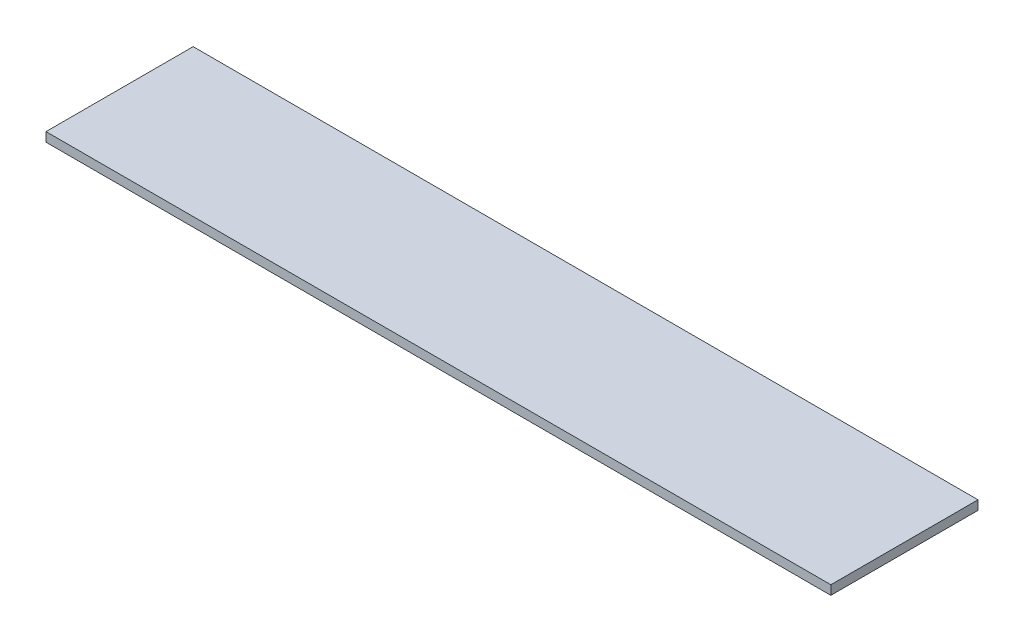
ISO-10303-21;
HEADER;
FILE_DESCRIPTION(('STEP AP214'),'2;1');
FILE_NAME('part.step','',(''),(''),'','','');
FILE_SCHEMA(('AUTOMOTIVE_DESIGN { 1 0 10303 214 1 1 1 1 }'));
ENDSEC;
DATA;
#1=APPLICATION_CONTEXT('core data for automotive mechanical design processes');
#2=APPLICATION_PROTOCOL_DEFINITION('international standard','automotive_design',2000,#1);
#3=PRODUCT_CONTEXT('',#1,'mechanical');
#4=PRODUCT('Part','Part','',(#3));
#5=PRODUCT_RELATED_PRODUCT_CATEGORY('part','',(#4));
#6=PRODUCT_DEFINITION_FORMATION('','',#4);
#7=PRODUCT_DEFINITION_CONTEXT('part definition',#1,'design');
#8=PRODUCT_DEFINITION('design','',#6,#7);
#9=PRODUCT_DEFINITION_SHAPE('','',#8);
#10=(LENGTH_UNIT() NAMED_UNIT(*) SI_UNIT(.MILLI.,.METRE.));
#11=(NAMED_UNIT(*) PLANE_ANGLE_UNIT() SI_UNIT($,.RADIAN.));
#12=(NAMED_UNIT(*) SI_UNIT($,.STERADIAN.) SOLID_ANGLE_UNIT());
#13=UNCERTAINTY_MEASURE_WITH_UNIT(LENGTH_MEASURE(1.E-05),#10,'distance_accuracy_value','');
#14=(GEOMETRIC_REPRESENTATION_CONTEXT(3) GLOBAL_UNCERTAINTY_ASSIGNED_CONTEXT((#13)) GLOBAL_UNIT_ASSIGNED_CONTEXT((#10,
#11,#12)) REPRESENTATION_CONTEXT('',''));
#15=CARTESIAN_POINT('',(0.,0.,0.));
#16=DIRECTION('',(0.,0.,1.));
#17=DIRECTION('',(1.,0.,0.));
#18=AXIS2_PLACEMENT_3D('',#15,#16,#17);
#19=CARTESIAN_POINT('',(812.8,19.05,-152.4));
#20=DIRECTION('',(-1.,0.,0.));
#21=DIRECTION('',(0.,0.,1.));
#22=AXIS2_PLACEMENT_3D('',#19,#20,#21);
#23=PLANE('',#22);
#24=DIRECTION('',(0.,0.,-1.));
#25=VECTOR('',#24,1.);
#26=CARTESIAN_POINT('',(812.8,0.,-152.4));
#27=LINE('',#26,#25);
#28=CARTESIAN_POINT('',(812.8,0.,152.4));
#29=VERTEX_POINT('',#28);
#30=CARTESIAN_POINT('',(812.8,0.,-152.4));
#31=VERTEX_POINT('',#30);
#32=EDGE_CURVE('E101',#29,#31,#27,.T.);
#33=ORIENTED_EDGE('',*,*,#32,.T.);
#34=DIRECTION('',(0.,-1.,0.));
#35=VECTOR('',#34,1.);
#36=CARTESIAN_POINT('',(812.8,19.05,-152.4));
#37=LINE('',#36,#35);
#38=CARTESIAN_POINT('',(812.8,19.05,-152.4));
#39=VERTEX_POINT('',#38);
#40=EDGE_CURVE('E11',#39,#31,#37,.T.);
#41=ORIENTED_EDGE('',*,*,#40,.F.);
#42=DIRECTION('',(0.,0.,-1.));
#43=VECTOR('',#42,1.);
#44=CARTESIAN_POINT('',(812.8,19.05,-152.4));
#45=LINE('',#44,#43);
#46=CARTESIAN_POINT('',(812.8,19.05,152.4));
#47=VERTEX_POINT('',#46);
#48=EDGE_CURVE('E87',#47,#39,#45,.T.);
#49=ORIENTED_EDGE('',*,*,#48,.F.);
#50=DIRECTION('',(0.,-1.,0.));
#51=VECTOR('',#50,1.);
#52=CARTESIAN_POINT('',(812.8,19.05,152.4));
#53=LINE('',#52,#51);
#54=EDGE_CURVE('E97',#47,#29,#53,.T.);
#55=ORIENTED_EDGE('',*,*,#54,.T.);
#56=EDGE_LOOP('',(#33,#41,#49,#55));
#57=FACE_BOUND('',#56,.T.);
#58=ADVANCED_FACE('F36',(#57),#23,.F.);
#59=CARTESIAN_POINT('',(-812.8,19.05,-152.4));
#60=DIRECTION('',(0.,0.,1.));
#61=DIRECTION('',(1.,0.,0.));
#62=AXIS2_PLACEMENT_3D('',#59,#60,#61);
#63=PLANE('',#62);
#64=DIRECTION('',(-1.,0.,0.));
#65=VECTOR('',#64,1.);
#66=CARTESIAN_POINT('',(-812.8,0.,-152.4));
#67=LINE('',#66,#65);
#68=CARTESIAN_POINT('',(-812.8,0.,-152.4));
#69=VERTEX_POINT('',#68);
#70=EDGE_CURVE('E92',#31,#69,#67,.T.);
#71=ORIENTED_EDGE('',*,*,#70,.T.);
#72=DIRECTION('',(0.,-1.,0.));
#73=VECTOR('',#72,1.);
#74=CARTESIAN_POINT('',(-812.8,19.05,-152.4));
#75=LINE('',#74,#73);
#76=CARTESIAN_POINT('',(-812.8,19.05,-152.4));
#77=VERTEX_POINT('',#76);
#78=EDGE_CURVE('E44',#77,#69,#75,.T.);
#79=ORIENTED_EDGE('',*,*,#78,.F.);
#80=DIRECTION('',(-1.,0.,0.));
#81=VECTOR('',#80,1.);
#82=CARTESIAN_POINT('',(-812.8,19.05,-152.4));
#83=LINE('',#82,#81);
#84=EDGE_CURVE('E82',#39,#77,#83,.T.);
#85=ORIENTED_EDGE('',*,*,#84,.F.);
#86=ORIENTED_EDGE('',*,*,#40,.T.);
#87=EDGE_LOOP('',(#71,#79,#85,#86));
#88=FACE_BOUND('',#87,.T.);
#89=ADVANCED_FACE('F91',(#88),#63,.F.);
#90=CARTESIAN_POINT('',(-812.8,19.05,-152.4));
#91=DIRECTION('',(1.,0.,0.));
#92=DIRECTION('',(0.,0.,-1.));
#93=AXIS2_PLACEMENT_3D('',#90,#91,#92);
#94=PLANE('',#93);
#95=DIRECTION('',(0.,0.,1.));
#96=VECTOR('',#95,1.);
#97=CARTESIAN_POINT('',(-812.8,0.,-152.4));
#98=LINE('',#97,#96);
#99=CARTESIAN_POINT('',(-812.8,0.,152.4));
#100=VERTEX_POINT('',#99);
#101=EDGE_CURVE('E69',#69,#100,#98,.T.);
#102=ORIENTED_EDGE('',*,*,#101,.T.);
#103=DIRECTION('',(0.,-1.,0.));
#104=VECTOR('',#103,1.);
#105=CARTESIAN_POINT('',(-812.8,19.05,152.4));
#106=LINE('',#105,#104);
#107=CARTESIAN_POINT('',(-812.8,19.05,152.4));
#108=VERTEX_POINT('',#107);
#109=EDGE_CURVE('E93',#108,#100,#106,.T.);
#110=ORIENTED_EDGE('',*,*,#109,.F.);
#111=DIRECTION('',(0.,0.,1.));
#112=VECTOR('',#111,1.);
#113=CARTESIAN_POINT('',(-812.8,19.05,-152.4));
#114=LINE('',#113,#112);
#115=EDGE_CURVE('E85',#77,#108,#114,.T.);
#116=ORIENTED_EDGE('',*,*,#115,.F.);
#117=ORIENTED_EDGE('',*,*,#78,.T.);
#118=EDGE_LOOP('',(#102,#110,#116,#117));
#119=FACE_BOUND('',#118,.T.);
#120=ADVANCED_FACE('F94',(#119),#94,.F.);
#121=CARTESIAN_POINT('',(-812.8,19.05,152.4));
#122=DIRECTION('',(0.,0.,-1.));
#123=DIRECTION('',(-1.,0.,0.));
#124=AXIS2_PLACEMENT_3D('',#121,#122,#123);
#125=PLANE('',#124);
#126=DIRECTION('',(1.,0.,0.));
#127=VECTOR('',#126,1.);
#128=CARTESIAN_POINT('',(-812.8,0.,152.4));
#129=LINE('',#128,#127);
#130=EDGE_CURVE('E75',#100,#29,#129,.T.);
#131=ORIENTED_EDGE('',*,*,#130,.T.);
#132=ORIENTED_EDGE('',*,*,#54,.F.);
#133=DIRECTION('',(1.,0.,0.));
#134=VECTOR('',#133,1.);
#135=CARTESIAN_POINT('',(-812.8,19.05,152.4));
#136=LINE('',#135,#134);
#137=EDGE_CURVE('E52',#108,#47,#136,.T.);
#138=ORIENTED_EDGE('',*,*,#137,.F.);
#139=ORIENTED_EDGE('',*,*,#109,.T.);
#140=EDGE_LOOP('',(#131,#132,#138,#139));
#141=FACE_BOUND('',#140,.T.);
#142=ADVANCED_FACE('F111',(#141),#125,.F.);
#143=CARTESIAN_POINT('',(0.,19.05,0.));
#144=DIRECTION('',(0.,1.,0.));
#145=DIRECTION('',(0.,0.,1.));
#146=AXIS2_PLACEMENT_3D('',#143,#144,#145);
#147=PLANE('',#146);
#148=ORIENTED_EDGE('',*,*,#48,.T.);
#149=ORIENTED_EDGE('',*,*,#84,.T.);
#150=ORIENTED_EDGE('',*,*,#115,.T.);
#151=ORIENTED_EDGE('',*,*,#137,.T.);
#152=EDGE_LOOP('',(#148,#149,#150,#151));
#153=FACE_BOUND('',#152,.T.);
#154=ADVANCED_FACE('F83',(#153),#147,.T.);
#155=CARTESIAN_POINT('',(0.,0.,0.));
#156=DIRECTION('',(0.,1.,0.));
#157=DIRECTION('',(0.,0.,1.));
#158=AXIS2_PLACEMENT_3D('',#155,#156,#157);
#159=PLANE('',#158);
#160=ORIENTED_EDGE('',*,*,#32,.F.);
#161=ORIENTED_EDGE('',*,*,#130,.F.);
#162=ORIENTED_EDGE('',*,*,#101,.F.);
#163=ORIENTED_EDGE('',*,*,#70,.F.);
#164=EDGE_LOOP('',(#160,#161,#162,#163));
#165=FACE_BOUND('',#164,.T.);
#166=ADVANCED_FACE('F114',(#165),#159,.F.);
#167=CLOSED_SHELL('',(#58,#89,#120,#142,#154,#166));
#168=MANIFOLD_SOLID_BREP('B2',#167);
#169=ADVANCED_BREP_SHAPE_REPRESENTATION('',(#18,#168),#14);
#170=SHAPE_DEFINITION_REPRESENTATION(#9,#169);
ENDSEC;
END-ISO-10303-21;
